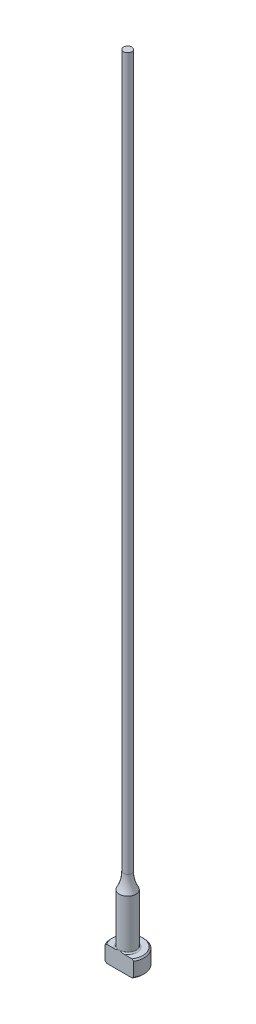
ISO-10303-21;
HEADER;
FILE_DESCRIPTION(('STEP AP214'),'2;1');
FILE_NAME('part.step','',(''),(''),'','','');
FILE_SCHEMA(('AUTOMOTIVE_DESIGN { 1 0 10303 214 1 1 1 1 }'));
ENDSEC;
DATA;
#1=APPLICATION_CONTEXT('core data for automotive mechanical design processes');
#2=APPLICATION_PROTOCOL_DEFINITION('international standard','automotive_design',2000,#1);
#3=PRODUCT_CONTEXT('',#1,'mechanical');
#4=PRODUCT('Part','Part','',(#3));
#5=PRODUCT_RELATED_PRODUCT_CATEGORY('part','',(#4));
#6=PRODUCT_DEFINITION_FORMATION('','',#4);
#7=PRODUCT_DEFINITION_CONTEXT('part definition',#1,'design');
#8=PRODUCT_DEFINITION('design','',#6,#7);
#9=PRODUCT_DEFINITION_SHAPE('','',#8);
#10=(LENGTH_UNIT() NAMED_UNIT(*) SI_UNIT(.MILLI.,.METRE.));
#11=(NAMED_UNIT(*) PLANE_ANGLE_UNIT() SI_UNIT($,.RADIAN.));
#12=(NAMED_UNIT(*) SI_UNIT($,.STERADIAN.) SOLID_ANGLE_UNIT());
#13=UNCERTAINTY_MEASURE_WITH_UNIT(LENGTH_MEASURE(1.E-05),#10,'distance_accuracy_value','');
#14=(GEOMETRIC_REPRESENTATION_CONTEXT(3) GLOBAL_UNCERTAINTY_ASSIGNED_CONTEXT((#13)) GLOBAL_UNIT_ASSIGNED_CONTEXT((#10,
#11,#12)) REPRESENTATION_CONTEXT('',''));
#15=CARTESIAN_POINT('',(0.,0.,0.));
#16=DIRECTION('',(0.,0.,1.));
#17=DIRECTION('',(1.,0.,0.));
#18=AXIS2_PLACEMENT_3D('',#15,#16,#17);
#19=CARTESIAN_POINT('',(-0.793749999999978,152.4,0.));
#20=DIRECTION('',(0.,1.,0.));
#21=DIRECTION('',(0.,0.,1.));
#22=AXIS2_PLACEMENT_3D('',#19,#20,#21);
#23=PLANE('',#22);
#24=CARTESIAN_POINT('',(0.,152.4,0.));
#25=DIRECTION('',(0.,1.,0.));
#26=DIRECTION('',(0.,0.,1.));
#27=AXIS2_PLACEMENT_3D('',#24,#25,#26);
#28=CIRCLE('',#27,0.793749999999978);
#29=CARTESIAN_POINT('',(0.,152.4,0.793749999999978));
#30=VERTEX_POINT('',#29);
#31=EDGE_CURVE('E164',#30,#30,#28,.T.);
#32=ORIENTED_EDGE('',*,*,#31,.T.);
#33=EDGE_LOOP('',(#32));
#34=FACE_BOUND('',#33,.T.);
#35=ADVANCED_FACE('F32',(#34),#23,.T.);
#36=CARTESIAN_POINT('',(0.,259.958771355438,0.));
#37=DIRECTION('',(0.,1.,0.));
#38=DIRECTION('',(0.,0.,1.));
#39=AXIS2_PLACEMENT_3D('',#36,#37,#38);
#40=CYLINDRICAL_SURFACE('',#39,0.793749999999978);
#41=CARTESIAN_POINT('',(0.,15.7741805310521,0.));
#42=DIRECTION('',(0.,1.,0.));
#43=DIRECTION('',(0.,0.,1.));
#44=AXIS2_PLACEMENT_3D('',#41,#42,#43);
#45=CIRCLE('',#44,0.793749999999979);
#46=CARTESIAN_POINT('',(0.,15.7741805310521,0.793749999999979));
#47=VERTEX_POINT('',#46);
#48=EDGE_CURVE('E167',#47,#47,#45,.T.);
#49=ORIENTED_EDGE('',*,*,#48,.T.);
#50=EDGE_LOOP('',(#49));
#51=FACE_BOUND('',#50,.T.);
#52=ORIENTED_EDGE('',*,*,#31,.F.);
#53=EDGE_LOOP('',(#52));
#54=FACE_BOUND('',#53,.T.);
#55=ADVANCED_FACE('F155',(#51,#54),#40,.T.);
#56=CARTESIAN_POINT('',(0.,15.7741805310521,0.));
#57=DIRECTION('',(0.,1.,0.));
#58=DIRECTION('',(0.,0.,1.));
#59=AXIS2_PLACEMENT_3D('',#56,#57,#58);
#60=TOROIDAL_SURFACE('',#59,7.14374999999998,6.35);
#61=CARTESIAN_POINT('',(0.,12.7,0.));
#62=DIRECTION('',(0.,1.,0.));
#63=DIRECTION('',(0.,0.,1.));
#64=AXIS2_PLACEMENT_3D('',#61,#62,#63);
#65=CIRCLE('',#64,1.58749999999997);
#66=CARTESIAN_POINT('',(0.,12.7,1.58749999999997));
#67=VERTEX_POINT('',#66);
#68=EDGE_CURVE('E95',#67,#67,#65,.T.);
#69=ORIENTED_EDGE('',*,*,#68,.T.);
#70=EDGE_LOOP('',(#69));
#71=FACE_BOUND('',#70,.T.);
#72=ORIENTED_EDGE('',*,*,#48,.F.);
#73=EDGE_LOOP('',(#72));
#74=FACE_BOUND('',#73,.T.);
#75=ADVANCED_FACE('F160',(#71,#74),#60,.F.);
#76=CARTESIAN_POINT('',(0.,259.958771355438,0.));
#77=DIRECTION('',(0.,1.,0.));
#78=DIRECTION('',(0.,0.,1.));
#79=AXIS2_PLACEMENT_3D('',#76,#77,#78);
#80=CYLINDRICAL_SURFACE('',#79,1.58749999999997);
#81=CARTESIAN_POINT('',(0.,3.42900000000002,0.));
#82=DIRECTION('',(0.,1.,0.));
#83=DIRECTION('',(0.,0.,1.));
#84=AXIS2_PLACEMENT_3D('',#81,#82,#83);
#85=CIRCLE('',#84,1.58749999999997);
#86=CARTESIAN_POINT('',(0.,3.42900000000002,1.58749999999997));
#87=VERTEX_POINT('',#86);
#88=EDGE_CURVE('E104',#87,#87,#85,.T.);
#89=ORIENTED_EDGE('',*,*,#88,.T.);
#90=EDGE_LOOP('',(#89));
#91=FACE_BOUND('',#90,.T.);
#92=ORIENTED_EDGE('',*,*,#68,.F.);
#93=EDGE_LOOP('',(#92));
#94=FACE_BOUND('',#93,.T.);
#95=ADVANCED_FACE('F187',(#91,#94),#80,.T.);
#96=CARTESIAN_POINT('',(-3.17499999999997,3.175,0.));
#97=DIRECTION('',(0.,1.,0.));
#98=DIRECTION('',(0.,0.,1.));
#99=AXIS2_PLACEMENT_3D('',#96,#97,#98);
#100=PLANE('',#99);
#101=DIRECTION('',(-1.,0.,0.));
#102=VECTOR('',#101,1.);
#103=CARTESIAN_POINT('',(-3.17499999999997,3.175,1.58749999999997));
#104=LINE('',#103,#102);
#105=CARTESIAN_POINT('',(2.45195529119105,3.175,1.58749999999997));
#106=VERTEX_POINT('',#105);
#107=CARTESIAN_POINT('',(0.933255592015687,3.175,1.58749999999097));
#108=VERTEX_POINT('',#107);
#109=EDGE_CURVE('E53',#106,#108,#104,.T.);
#110=ORIENTED_EDGE('',*,*,#109,.F.);
#111=CARTESIAN_POINT('',(0.,3.175,0.));
#112=DIRECTION('',(0.,1.,0.));
#113=DIRECTION('',(0.,0.,1.));
#114=AXIS2_PLACEMENT_3D('',#111,#112,#113);
#115=CIRCLE('',#114,2.92099999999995);
#116=CARTESIAN_POINT('',(-2.45195529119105,3.175,1.58749999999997));
#117=VERTEX_POINT('',#116);
#118=EDGE_CURVE('E166',#106,#117,#115,.T.);
#119=ORIENTED_EDGE('',*,*,#118,.T.);
#120=CARTESIAN_POINT('',(-0.933255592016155,3.17500000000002,1.58749999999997));
#121=VERTEX_POINT('',#120);
#122=EDGE_CURVE('E135',#121,#117,#104,.T.);
#123=ORIENTED_EDGE('',*,*,#122,.F.);
#124=CARTESIAN_POINT('',(0.,3.175,0.));
#125=DIRECTION('',(0.,1.,0.));
#126=DIRECTION('',(0.,0.,1.));
#127=AXIS2_PLACEMENT_3D('',#124,#125,#126);
#128=CIRCLE('',#127,1.84149999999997);
#129=EDGE_CURVE('E108',#121,#108,#128,.F.);
#130=ORIENTED_EDGE('',*,*,#129,.T.);
#131=EDGE_LOOP('',(#110,#119,#123,#130));
#132=FACE_BOUND('',#131,.T.);
#133=ADVANCED_FACE('F184',(#132),#100,.T.);
#134=CARTESIAN_POINT('',(0.,259.958771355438,0.));
#135=DIRECTION('',(0.,1.,0.));
#136=DIRECTION('',(0.,0.,1.));
#137=AXIS2_PLACEMENT_3D('',#134,#135,#136);
#138=CYLINDRICAL_SURFACE('',#137,3.17499999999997);
#139=DIRECTION('',(0.,-1.,0.));
#140=VECTOR('',#139,1.);
#141=CARTESIAN_POINT('',(-2.74963065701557,152.4,1.58749999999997));
#142=LINE('',#141,#140);
#143=CARTESIAN_POINT('',(-2.74963065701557,2.921,1.58749999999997));
#144=VERTEX_POINT('',#143);
#145=CARTESIAN_POINT('',(-2.74963065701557,0.254000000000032,1.58749999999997));
#146=VERTEX_POINT('',#145);
#147=EDGE_CURVE('E90',#144,#146,#142,.T.);
#148=ORIENTED_EDGE('',*,*,#147,.F.);
#149=CARTESIAN_POINT('',(0.,2.92100000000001,0.));
#150=DIRECTION('',(0.,1.,0.));
#151=DIRECTION('',(0.,0.,1.));
#152=AXIS2_PLACEMENT_3D('',#149,#150,#151);
#153=CIRCLE('',#152,3.17499999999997);
#154=CARTESIAN_POINT('',(2.74963065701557,2.921,1.58749999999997));
#155=VERTEX_POINT('',#154);
#156=EDGE_CURVE('E105',#144,#155,#153,.F.);
#157=ORIENTED_EDGE('',*,*,#156,.T.);
#158=DIRECTION('',(0.,-1.,0.));
#159=VECTOR('',#158,1.);
#160=CARTESIAN_POINT('',(2.74963065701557,152.4,1.58749999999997));
#161=LINE('',#160,#159);
#162=CARTESIAN_POINT('',(2.74963065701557,0.254000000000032,1.58749999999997));
#163=VERTEX_POINT('',#162);
#164=EDGE_CURVE('E177',#155,#163,#161,.T.);
#165=ORIENTED_EDGE('',*,*,#164,.T.);
#166=CARTESIAN_POINT('',(0.,0.254000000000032,0.));
#167=DIRECTION('',(0.,-1.,0.));
#168=DIRECTION('',(0.,0.,-1.));
#169=AXIS2_PLACEMENT_3D('',#166,#167,#168);
#170=CIRCLE('',#169,3.17499999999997);
#171=EDGE_CURVE('E111',#163,#146,#170,.F.);
#172=ORIENTED_EDGE('',*,*,#171,.T.);
#173=EDGE_LOOP('',(#148,#157,#165,#172));
#174=FACE_BOUND('',#173,.T.);
#175=ADVANCED_FACE('F175',(#174),#138,.T.);
#176=CARTESIAN_POINT('',(0.,0.,0.));
#177=DIRECTION('',(0.,-1.,0.));
#178=DIRECTION('',(0.,0.,-1.));
#179=AXIS2_PLACEMENT_3D('',#176,#177,#178);
#180=PLANE('',#179);
#181=DIRECTION('',(1.,0.,0.));
#182=VECTOR('',#181,1.);
#183=CARTESIAN_POINT('',(-2.74963065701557,0.,1.58749999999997));
#184=LINE('',#183,#182);
#185=CARTESIAN_POINT('',(-2.45195529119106,0.,1.58749999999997));
#186=VERTEX_POINT('',#185);
#187=CARTESIAN_POINT('',(2.45195529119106,0.,1.58749999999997));
#188=VERTEX_POINT('',#187);
#189=EDGE_CURVE('E87',#186,#188,#184,.T.);
#190=ORIENTED_EDGE('',*,*,#189,.F.);
#191=CARTESIAN_POINT('',(0.,0.,0.));
#192=DIRECTION('',(0.,-1.,0.));
#193=DIRECTION('',(0.,0.,-1.));
#194=AXIS2_PLACEMENT_3D('',#191,#192,#193);
#195=CIRCLE('',#194,2.92099999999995);
#196=EDGE_CURVE('E101',#186,#188,#195,.T.);
#197=ORIENTED_EDGE('',*,*,#196,.T.);
#198=EDGE_LOOP('',(#190,#197));
#199=FACE_BOUND('',#198,.T.);
#200=ADVANCED_FACE('F100',(#199),#180,.T.);
#201=CARTESIAN_POINT('',(0.,3.17499999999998,0.));
#202=DIRECTION('',(0.,-1.,0.));
#203=DIRECTION('',(0.,0.,-1.));
#204=AXIS2_PLACEMENT_3D('',#201,#202,#203);
#205=CONICAL_SURFACE('',#204,2.92099999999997,0.7853981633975);
#206=CARTESIAN_POINT('',(6.0529050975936,-0.161620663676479,1.58749999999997));
#207=CARTESIAN_POINT('',(5.91567682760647,-0.0288893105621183,1.58749999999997));
#208=CARTESIAN_POINT('',(5.77831035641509,0.103699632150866,1.58749999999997));
#209=CARTESIAN_POINT('',(5.5032187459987,0.368508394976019,1.58749999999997));
#210=CARTESIAN_POINT('',(5.36549360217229,0.500728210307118,1.58749999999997));
#211=CARTESIAN_POINT('',(5.08953516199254,0.764778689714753,1.58749999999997));
#212=CARTESIAN_POINT('',(4.95130164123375,0.896609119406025,1.58749999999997));
#213=CARTESIAN_POINT('',(4.67428233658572,1.15968706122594,1.58749999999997));
#214=CARTESIAN_POINT('',(4.53549655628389,1.29093457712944,1.58749999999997));
#215=CARTESIAN_POINT('',(4.2599772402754,1.55007705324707,1.58749999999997));
#216=CARTESIAN_POINT('',(4.12325766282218,1.67798684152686,1.58749999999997));
#217=CARTESIAN_POINT('',(3.84892898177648,1.93284861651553,1.58749999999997));
#218=CARTESIAN_POINT('',(3.71131988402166,2.05980060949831,1.58749999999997));
#219=CARTESIAN_POINT('',(3.43493978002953,2.31237508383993,1.58749999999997));
#220=CARTESIAN_POINT('',(3.29616903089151,2.43799784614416,1.58749999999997));
#221=CARTESIAN_POINT('',(3.01699558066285,2.68741369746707,1.58749999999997));
#222=CARTESIAN_POINT('',(2.87659294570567,2.81120686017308,1.58749999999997));
#223=CARTESIAN_POINT('',(2.6481670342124,3.0087586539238,1.58749999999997));
#224=CARTESIAN_POINT('',(2.56087478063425,3.08336151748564,1.58749999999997));
#225=CARTESIAN_POINT('',(2.38515423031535,3.23123871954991,1.58749999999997));
#226=CARTESIAN_POINT('',(2.29672582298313,3.30451292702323,1.58749999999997));
#227=CARTESIAN_POINT('',(2.1174740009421,3.45004422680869,1.58749999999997));
#228=CARTESIAN_POINT('',(2.02663514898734,3.52228237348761,1.58749999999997));
#229=CARTESIAN_POINT('',(1.8430252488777,3.66423097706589,1.58749999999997));
#230=CARTESIAN_POINT('',(1.75025467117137,3.73394203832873,1.58749999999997));
#231=CARTESIAN_POINT('',(1.56067475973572,3.87080633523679,1.58749999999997));
#232=CARTESIAN_POINT('',(1.4638254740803,3.93790459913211,1.58749999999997));
#233=CARTESIAN_POINT('',(1.266325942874,4.06669147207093,1.58749999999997));
#234=CARTESIAN_POINT('',(1.16567073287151,4.12837264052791,1.58749999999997));
#235=CARTESIAN_POINT('',(1.01165766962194,4.2140225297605,1.58749999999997));
#236=CARTESIAN_POINT('',(0.960142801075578,4.24127929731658,1.58749999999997));
#237=CARTESIAN_POINT('',(0.855780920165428,4.29309798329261,1.58749999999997));
#238=CARTESIAN_POINT('',(0.802933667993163,4.31765941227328,1.58749999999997));
#239=CARTESIAN_POINT('',(0.642461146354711,4.38614656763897,1.58749999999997));
#240=CARTESIAN_POINT('',(0.532518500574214,4.42510149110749,1.58749999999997));
#241=CARTESIAN_POINT('',(0.36768038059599,4.46726244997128,1.58749999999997));
#242=CARTESIAN_POINT('',(0.314802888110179,4.47844427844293,1.58749999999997));
#243=CARTESIAN_POINT('',(0.208209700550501,4.495766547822,1.58749999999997));
#244=CARTESIAN_POINT('',(0.154494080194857,4.50190743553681,1.58749999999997));
#245=CARTESIAN_POINT('',(0.0468792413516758,4.50871296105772,1.58749999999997));
#246=CARTESIAN_POINT('',(-0.00701889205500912,4.50939451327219,1.58749999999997));
#247=CARTESIAN_POINT('',(-0.114606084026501,4.50527679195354,1.58749999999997));
#248=CARTESIAN_POINT('',(-0.16829512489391,4.50047706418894,1.58749999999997));
#249=CARTESIAN_POINT('',(-0.274485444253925,4.48579689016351,1.58749999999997));
#250=CARTESIAN_POINT('',(-0.326992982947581,4.47596081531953,1.58749999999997));
#251=CARTESIAN_POINT('',(-0.430974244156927,4.45181809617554,1.58749999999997));
#252=CARTESIAN_POINT('',(-0.482447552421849,4.43750969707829,1.58749999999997));
#253=CARTESIAN_POINT('',(-0.584460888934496,4.40502489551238,1.58749999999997));
#254=CARTESIAN_POINT('',(-0.63499406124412,4.38682724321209,1.58749999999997));
#255=CARTESIAN_POINT('',(-0.734789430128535,4.34729308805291,1.58749999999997));
#256=CARTESIAN_POINT('',(-0.784051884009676,4.32595722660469,1.58749999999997));
#257=CARTESIAN_POINT('',(-0.930549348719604,4.25791922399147,1.58749999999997));
#258=CARTESIAN_POINT('',(-1.02598802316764,4.20736047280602,1.58749999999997));
#259=CARTESIAN_POINT('',(-1.21304313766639,4.09955451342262,1.58749999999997));
#260=CARTESIAN_POINT('',(-1.30465471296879,4.04229912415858,1.58749999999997));
#261=CARTESIAN_POINT('',(-1.48526211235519,3.9230874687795,1.58749999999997));
#262=CARTESIAN_POINT('',(-1.57424615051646,3.86111349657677,1.58749999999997));
#263=CARTESIAN_POINT('',(-1.74990003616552,3.73408621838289,1.58749999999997));
#264=CARTESIAN_POINT('',(-1.83657099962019,3.66903444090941,1.58749999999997));
#265=CARTESIAN_POINT('',(-2.00931764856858,3.53583371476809,1.58749999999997));
#266=CARTESIAN_POINT('',(-2.09537048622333,3.46765527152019,1.58749999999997));
#267=CARTESIAN_POINT('',(-2.26611736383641,3.32960643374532,1.58749999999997));
#268=CARTESIAN_POINT('',(-2.35081125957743,3.25973586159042,1.58749999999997));
#269=CARTESIAN_POINT('',(-2.60290121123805,3.04858139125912,1.58749999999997));
#270=CARTESIAN_POINT('',(-2.76872537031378,2.9054238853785,1.58749999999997));
#271=CARTESIAN_POINT('',(-3.06970913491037,2.64069522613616,1.58749999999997));
#272=CARTESIAN_POINT('',(-3.20528660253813,2.51959458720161,1.58749999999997));
#273=CARTESIAN_POINT('',(-3.47510321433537,2.275904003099,1.58749999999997));
#274=CARTESIAN_POINT('',(-3.60934232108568,2.15331401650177,1.58749999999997));
#275=CARTESIAN_POINT('',(-3.87695374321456,1.90694239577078,1.58749999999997));
#276=CARTESIAN_POINT('',(-4.01032512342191,1.78315974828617,1.58749999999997));
#277=CARTESIAN_POINT('',(-4.2763088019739,1.53478104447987,1.58749999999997));
#278=CARTESIAN_POINT('',(-4.40892109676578,1.41018498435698,1.58749999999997));
#279=CARTESIAN_POINT('',(-4.79499418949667,1.0457468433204,1.58749999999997));
#280=CARTESIAN_POINT('',(-5.04767313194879,0.805076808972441,1.58749999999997));
#281=CARTESIAN_POINT('',(-5.42550911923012,0.443121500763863,1.58749999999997));
#282=CARTESIAN_POINT('',(-5.55118772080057,0.322378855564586,1.58749999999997));
#283=CARTESIAN_POINT('',(-5.80225207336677,0.0805914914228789,1.58749999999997));
#284=CARTESIAN_POINT('',(-5.92763782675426,-0.0404532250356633,1.58749999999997));
#285=CARTESIAN_POINT('',(-6.0529050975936,-0.161620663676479,1.58749999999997));
#286=B_SPLINE_CURVE_WITH_KNOTS('',3,(#206,#207,#208,#209,#210,#211,#212,#213,#214,#215,#216,
#217,#218,#219,#220,#221,#222,#223,#224,#225,#226,#227,#228,#229,#230,#231,#232,#233,#234,#235,
#236,#237,#238,#239,#240,#241,#242,#243,#244,#245,#246,#247,#248,#249,#250,#251,#252,#253,#254,
#255,#256,#257,#258,#259,#260,#261,#262,#263,#264,#265,#266,#267,#268,#269,#270,#271,#272,#273,
#274,#275,#276,#277,#278,#279,#280,#281,#282,#283,#284,#285),.UNSPECIFIED.,.F.,.F.,(4,2,2,2,2,2,
2,2,2,2,2,2,2,2,2,2,2,2,2,2,2,2,2,2,2,2,2,2,2,2,2,2,2,2,2,2,2,2,2,4),(0.,0.572750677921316,
1.14550874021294,1.71856057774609,2.29160869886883,2.85328006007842,3.41494773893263,
3.97649423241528,4.53801804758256,4.88249307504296,5.22700189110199,5.57515326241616,
5.92322081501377,6.27657800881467,6.63041319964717,6.80518126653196,6.97998101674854,
7.32824262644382,7.49018491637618,7.65211285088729,7.813538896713,7.97497832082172,
8.13501929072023,8.29512313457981,8.4561251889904,8.61709438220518,8.94062993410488,
9.26456495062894,9.58978187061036,9.91483894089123,10.2441741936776,10.5735441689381,
11.2306812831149,11.7760337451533,12.3214014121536,12.8672825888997,13.4131663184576,
14.4600164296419,14.9828595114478,15.505698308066),.UNSPECIFIED.);
#287=EDGE_CURVE('E58',#155,#106,#286,.T.);
#288=ORIENTED_EDGE('',*,*,#287,.F.);
#289=ORIENTED_EDGE('',*,*,#156,.F.);
#290=EDGE_CURVE('E128',#117,#144,#286,.T.);
#291=ORIENTED_EDGE('',*,*,#290,.F.);
#292=ORIENTED_EDGE('',*,*,#118,.F.);
#293=EDGE_LOOP('',(#288,#289,#291,#292));
#294=FACE_BOUND('',#293,.T.);
#295=ADVANCED_FACE('F142',(#294),#205,.T.);
#296=CARTESIAN_POINT('',(0.,0.254000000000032,0.));
#297=DIRECTION('',(0.,1.,0.));
#298=DIRECTION('',(0.,0.,1.));
#299=AXIS2_PLACEMENT_3D('',#296,#297,#298);
#300=CONICAL_SURFACE('',#299,3.17499999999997,0.785398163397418);
#301=CARTESIAN_POINT('',(-6.0529050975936,3.33662066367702,1.58749999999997));
#302=CARTESIAN_POINT('',(-5.91567682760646,3.20388931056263,1.58749999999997));
#303=CARTESIAN_POINT('',(-5.77831035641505,3.0713003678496,1.58749999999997));
#304=CARTESIAN_POINT('',(-5.50321874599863,2.80649160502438,1.58749999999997));
#305=CARTESIAN_POINT('',(-5.36549360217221,2.67427178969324,1.58749999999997));
#306=CARTESIAN_POINT('',(-5.08953516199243,2.41022131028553,1.58749999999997));
#307=CARTESIAN_POINT('',(-4.95130164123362,2.27839088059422,1.58749999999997));
#308=CARTESIAN_POINT('',(-4.67428233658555,2.01531293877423,1.58749999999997));
#309=CARTESIAN_POINT('',(-4.5354965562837,1.8840654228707,1.58749999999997));
#310=CARTESIAN_POINT('',(-4.25997724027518,1.62492294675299,1.58749999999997));
#311=CARTESIAN_POINT('',(-4.12325766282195,1.49701315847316,1.58749999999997));
#312=CARTESIAN_POINT('',(-3.84892898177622,1.24215138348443,1.58749999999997));
#313=CARTESIAN_POINT('',(-3.71131988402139,1.11519939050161,1.58749999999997));
#314=CARTESIAN_POINT('',(-3.43493978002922,0.862624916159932,1.58749999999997));
#315=CARTESIAN_POINT('',(-3.29616903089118,0.737002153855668,1.58749999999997));
#316=CARTESIAN_POINT('',(-3.01699558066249,0.487586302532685,1.58749999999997));
#317=CARTESIAN_POINT('',(-2.8765929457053,0.363793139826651,1.58749999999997));
#318=CARTESIAN_POINT('',(-2.64816703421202,0.1662413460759,1.58749999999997));
#319=CARTESIAN_POINT('',(-2.56087478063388,0.0916384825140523,1.58749999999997));
#320=CARTESIAN_POINT('',(-2.385154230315,-0.0562387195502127,1.58749999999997));
#321=CARTESIAN_POINT('',(-2.29672582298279,-0.129512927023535,1.58749999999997));
#322=CARTESIAN_POINT('',(-2.11747400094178,-0.275044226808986,1.58749999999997));
#323=CARTESIAN_POINT('',(-2.02663514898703,-0.34728237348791,1.58749999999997));
#324=CARTESIAN_POINT('',(-1.84302524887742,-0.489230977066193,1.58749999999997));
#325=CARTESIAN_POINT('',(-1.75025467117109,-0.558942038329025,1.58749999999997));
#326=CARTESIAN_POINT('',(-1.56067475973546,-0.695806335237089,1.58749999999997));
#327=CARTESIAN_POINT('',(-1.46382547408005,-0.762904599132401,1.58749999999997));
#328=CARTESIAN_POINT('',(-1.26632594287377,-0.89169147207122,1.58749999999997));
#329=CARTESIAN_POINT('',(-1.16567073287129,-0.953372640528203,1.58749999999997));
#330=CARTESIAN_POINT('',(-1.01165766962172,-1.03902252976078,1.58749999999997));
#331=CARTESIAN_POINT('',(-0.960142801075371,-1.06627929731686,1.58749999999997));
#332=CARTESIAN_POINT('',(-0.855780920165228,-1.11809798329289,1.58749999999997));
#333=CARTESIAN_POINT('',(-0.802933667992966,-1.14265941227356,1.58749999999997));
#334=CARTESIAN_POINT('',(-0.642461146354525,-1.21114656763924,1.58749999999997));
#335=CARTESIAN_POINT('',(-0.532518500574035,-1.25010149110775,1.58749999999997));
#336=CARTESIAN_POINT('',(-0.367680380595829,-1.29226244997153,1.58749999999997));
#337=CARTESIAN_POINT('',(-0.314802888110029,-1.30344427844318,1.58749999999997));
#338=CARTESIAN_POINT('',(-0.208209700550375,-1.32076654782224,1.58749999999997));
#339=CARTESIAN_POINT('',(-0.154494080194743,-1.32690743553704,1.58749999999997));
#340=CARTESIAN_POINT('',(-0.0468792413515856,-1.33371296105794,1.58749999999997));
#341=CARTESIAN_POINT('',(0.00701889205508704,-1.33439451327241,1.58749999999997));
#342=CARTESIAN_POINT('',(0.114606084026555,-1.33027679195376,1.58749999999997));
#343=CARTESIAN_POINT('',(0.168295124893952,-1.32547706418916,1.58749999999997));
#344=CARTESIAN_POINT('',(0.274485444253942,-1.31079689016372,1.58749999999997));
#345=CARTESIAN_POINT('',(0.326992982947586,-1.30096081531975,1.58749999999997));
#346=CARTESIAN_POINT('',(0.430974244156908,-1.27681809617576,1.58749999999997));
#347=CARTESIAN_POINT('',(0.482447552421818,-1.26250969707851,1.58749999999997));
#348=CARTESIAN_POINT('',(0.58446088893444,-1.2300248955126,1.58749999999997));
#349=CARTESIAN_POINT('',(0.634994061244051,-1.21182724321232,1.58749999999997));
#350=CARTESIAN_POINT('',(0.734789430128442,-1.17229308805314,1.58749999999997));
#351=CARTESIAN_POINT('',(0.784051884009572,-1.15095722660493,1.58749999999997));
#352=CARTESIAN_POINT('',(0.930549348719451,-1.08291922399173,1.58749999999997));
#353=CARTESIAN_POINT('',(1.02598802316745,-1.0323604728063,1.58749999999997));
#354=CARTESIAN_POINT('',(1.21304313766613,-0.924554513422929,1.58749999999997));
#355=CARTESIAN_POINT('',(1.30465471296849,-0.867299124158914,1.58749999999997));
#356=CARTESIAN_POINT('',(1.48526211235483,-0.748087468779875,1.58749999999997));
#357=CARTESIAN_POINT('',(1.57424615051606,-0.686113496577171,1.58749999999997));
#358=CARTESIAN_POINT('',(1.74990003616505,-0.559086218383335,1.58749999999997));
#359=CARTESIAN_POINT('',(1.83657099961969,-0.494034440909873,1.58749999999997));
#360=CARTESIAN_POINT('',(2.00931764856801,-0.360833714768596,1.58749999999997));
#361=CARTESIAN_POINT('',(2.09537048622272,-0.292655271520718,1.58749999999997));
#362=CARTESIAN_POINT('',(2.26611736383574,-0.1546064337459,1.58749999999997));
#363=CARTESIAN_POINT('',(2.35081125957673,-0.0847358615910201,1.58749999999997));
#364=CARTESIAN_POINT('',(2.60290121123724,0.126418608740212,1.58749999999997));
#365=CARTESIAN_POINT('',(2.76872537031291,0.269576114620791,1.58749999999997));
#366=CARTESIAN_POINT('',(3.06970913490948,0.534304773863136,1.58749999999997));
#367=CARTESIAN_POINT('',(3.20528660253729,0.65540541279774,1.58749999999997));
#368=CARTESIAN_POINT('',(3.47510321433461,0.899095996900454,1.58749999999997));
#369=CARTESIAN_POINT('',(3.60934232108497,1.02168598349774,1.58749999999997));
#370=CARTESIAN_POINT('',(3.87695374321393,1.26805760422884,1.58749999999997));
#371=CARTESIAN_POINT('',(4.01032512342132,1.39184025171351,1.58749999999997));
#372=CARTESIAN_POINT('',(4.2763088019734,1.64021895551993,1.58749999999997));
#373=CARTESIAN_POINT('',(4.40892109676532,1.76481501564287,1.58749999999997));
#374=CARTESIAN_POINT('',(4.79499418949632,2.12925315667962,1.58749999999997));
#375=CARTESIAN_POINT('',(5.04767313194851,2.36992319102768,1.58749999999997));
#376=CARTESIAN_POINT('',(5.42550911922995,2.73187849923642,1.58749999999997));
#377=CARTESIAN_POINT('',(5.55118772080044,2.85262114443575,1.58749999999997));
#378=CARTESIAN_POINT('',(5.8022520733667,3.09440850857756,1.58749999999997));
#379=CARTESIAN_POINT('',(5.92763782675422,3.21545322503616,1.58749999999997));
#380=CARTESIAN_POINT('',(6.0529050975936,3.33662066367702,1.58749999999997));
#381=B_SPLINE_CURVE_WITH_KNOTS('',3,(#301,#302,#303,#304,#305,#306,#307,#308,#309,#310,#311,
#312,#313,#314,#315,#316,#317,#318,#319,#320,#321,#322,#323,#324,#325,#326,#327,#328,#329,#330,
#331,#332,#333,#334,#335,#336,#337,#338,#339,#340,#341,#342,#343,#344,#345,#346,#347,#348,#349,
#350,#351,#352,#353,#354,#355,#356,#357,#358,#359,#360,#361,#362,#363,#364,#365,#366,#367,#368,
#369,#370,#371,#372,#373,#374,#375,#376,#377,#378,#379,#380),.UNSPECIFIED.,.F.,.F.,(4,2,2,2,2,2,
2,2,2,2,2,2,2,2,2,2,2,2,2,2,2,2,2,2,2,2,2,2,2,2,2,2,2,2,2,2,2,2,2,4),(0.,0.57275067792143,
1.14550874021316,1.71856057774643,2.29160869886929,2.85328006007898,3.41494773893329,
3.97649423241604,4.53801804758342,4.8824930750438,5.22700189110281,5.57515326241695,
5.92322081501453,6.27657800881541,6.63041319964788,6.80518126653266,6.97998101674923,
7.32824262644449,7.49018491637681,7.65211285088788,7.81353889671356,7.97497832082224,
8.13501929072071,8.29512313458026,8.45612518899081,8.61709438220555,8.94062993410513,
9.26456495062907,9.58978187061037,9.91483894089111,10.2441741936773,10.5735441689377,
11.2306812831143,11.776033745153,12.3214014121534,12.8672825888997,13.4131663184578,
14.4600164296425,14.9828595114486,15.505698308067),.UNSPECIFIED.);
#382=EDGE_CURVE('E84',#146,#186,#381,.T.);
#383=ORIENTED_EDGE('',*,*,#382,.F.);
#384=ORIENTED_EDGE('',*,*,#171,.F.);
#385=EDGE_CURVE('E96',#188,#163,#381,.T.);
#386=ORIENTED_EDGE('',*,*,#385,.F.);
#387=ORIENTED_EDGE('',*,*,#196,.F.);
#388=EDGE_LOOP('',(#383,#384,#386,#387));
#389=FACE_BOUND('',#388,.T.);
#390=ADVANCED_FACE('F103',(#389),#300,.T.);
#391=CARTESIAN_POINT('',(0.,3.42900000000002,0.));
#392=DIRECTION('',(0.,1.,0.));
#393=DIRECTION('',(0.,0.,1.));
#394=AXIS2_PLACEMENT_3D('',#391,#392,#393);
#395=TOROIDAL_SURFACE('',#394,1.84149999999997,0.254);
#396=ORIENTED_EDGE('',*,*,#129,.F.);
#397=CARTESIAN_POINT('',(0.,3.42900000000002,1.58749999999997));
#398=CARTESIAN_POINT('',(-1.92205022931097E-10,3.42900057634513,1.58749999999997));
#399=CARTESIAN_POINT('',(-1.22611612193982E-07,3.42900115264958,1.58749999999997));
#400=CARTESIAN_POINT('',(-5.09676358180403E-07,3.42900226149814,1.58749999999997));
#401=CARTESIAN_POINT('',(-7.78176318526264E-07,3.42900279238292,1.58749999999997));
#402=CARTESIAN_POINT('',(-1.42307271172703E-06,3.42900385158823,1.58749999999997));
#403=CARTESIAN_POINT('',(-1.80713865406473E-06,3.4290043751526,1.58749999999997));
#404=CARTESIAN_POINT('',(-2.63494844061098E-06,3.42900536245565,1.58749999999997));
#405=CARTESIAN_POINT('',(-3.07814754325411E-06,3.42900582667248,1.58749999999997));
#406=CARTESIAN_POINT('',(-4.6689735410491E-06,3.4290073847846,1.58749999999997));
#407=CARTESIAN_POINT('',(-5.89404904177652E-06,3.42900840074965,1.58749999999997));
#408=CARTESIAN_POINT('',(-8.42427506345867E-06,3.42901020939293,1.58749999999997));
#409=CARTESIAN_POINT('',(-9.72480569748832E-06,3.42901100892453,1.58749999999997));
#410=CARTESIAN_POINT('',(-1.48060601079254E-05,3.42901401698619,1.58749999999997));
#411=CARTESIAN_POINT('',(-1.86838280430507E-05,3.42901606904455,1.58749999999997));
#412=CARTESIAN_POINT('',(-2.6326111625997E-05,3.42901942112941,1.58749999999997));
#413=CARTESIAN_POINT('',(-3.00687416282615E-05,3.42902077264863,1.58749999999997));
#414=CARTESIAN_POINT('',(-4.6027629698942E-05,3.4290265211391,1.58749999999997));
#415=CARTESIAN_POINT('',(-5.82470196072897E-05,3.42903088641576,1.58749999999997));
#416=CARTESIAN_POINT('',(-8.11070094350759E-05,3.42903788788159,1.58749999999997));
#417=CARTESIAN_POINT('',(-9.16953111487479E-05,3.42904068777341,1.58749999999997));
#418=CARTESIAN_POINT('',(-0.000168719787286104,3.42906287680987,1.58749999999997));
#419=CARTESIAN_POINT('',(-0.000232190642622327,3.42909118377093,1.58749999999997));
#420=CARTESIAN_POINT('',(-0.000479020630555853,3.42919723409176,1.58749999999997));
#421=CARTESIAN_POINT('',(-0.000664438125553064,3.42926834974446,1.58749999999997));
#422=CARTESIAN_POINT('',(-0.00138448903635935,3.4295486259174,1.58749999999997));
#423=CARTESIAN_POINT('',(-0.00191701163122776,3.42976473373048,1.58749999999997));
#424=CARTESIAN_POINT('',(-0.00409774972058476,3.43064550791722,1.58749999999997));
#425=CARTESIAN_POINT('',(-0.00574830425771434,3.43130231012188,1.58749999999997));
#426=CARTESIAN_POINT('',(-0.0289985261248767,3.44055947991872,1.58749999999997));
#427=CARTESIAN_POINT('',(-0.0505816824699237,3.44921674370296,1.58749999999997));
#428=CARTESIAN_POINT('',(-0.0929947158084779,3.46610702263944,1.58749999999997));
#429=CARTESIAN_POINT('',(-0.113823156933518,3.47434394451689,1.58749999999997));
#430=CARTESIAN_POINT('',(-0.157956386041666,3.49164606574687,1.58749999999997));
#431=CARTESIAN_POINT('',(-0.181267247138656,3.50069608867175,1.58749999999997));
#432=CARTESIAN_POINT('',(-0.228222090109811,3.51863224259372,1.58749999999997));
#433=CARTESIAN_POINT('',(-0.251867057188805,3.52751579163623,1.58749999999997));
#434=CARTESIAN_POINT('',(-0.310512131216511,3.54905503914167,1.58749999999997));
#435=CARTESIAN_POINT('',(-0.345588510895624,3.56150550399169,1.58749999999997));
#436=CARTESIAN_POINT('',(-0.415278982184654,3.58503024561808,1.58749999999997));
#437=CARTESIAN_POINT('',(-0.449884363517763,3.59613012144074,1.58749999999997));
#438=CARTESIAN_POINT('',(-0.52447121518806,3.61841679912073,1.58749999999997));
#439=CARTESIAN_POINT('',(-0.56451722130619,3.62939137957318,1.58749999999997));
#440=CARTESIAN_POINT('',(-0.645529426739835,3.6489746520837,1.58749999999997));
#441=CARTESIAN_POINT('',(-0.686500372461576,3.65756417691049,1.58749999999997));
#442=CARTESIAN_POINT('',(-0.771546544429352,3.67188287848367,1.58749999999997));
#443=CARTESIAN_POINT('',(-0.815658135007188,3.67740449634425,1.58749999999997));
#444=CARTESIAN_POINT('',(-0.904117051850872,3.68344603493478,1.58749999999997));
#445=CARTESIAN_POINT('',(-0.948462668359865,3.68398638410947,1.58749999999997));
#446=CARTESIAN_POINT('',(-1.02531896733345,3.67901051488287,1.58749999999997));
#447=CARTESIAN_POINT('',(-1.05792141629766,3.67502604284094,1.58749999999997));
#448=CARTESIAN_POINT('',(-1.12184393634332,3.6623083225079,1.58749999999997));
#449=CARTESIAN_POINT('',(-1.15317534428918,3.65363950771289,1.58749999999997));
#450=CARTESIAN_POINT('',(-1.19946468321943,3.63563847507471,1.58749999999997));
#451=CARTESIAN_POINT('',(-1.2152678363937,3.62848492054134,1.58749999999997));
#452=CARTESIAN_POINT('',(-1.24583726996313,3.61212937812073,1.58749999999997));
#453=CARTESIAN_POINT('',(-1.26060215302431,3.60292469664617,1.58749999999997));
#454=CARTESIAN_POINT('',(-1.28575815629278,3.58421518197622,1.58749999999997));
#455=CARTESIAN_POINT('',(-1.29644383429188,3.57510998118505,1.58749999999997));
#456=CARTESIAN_POINT('',(-1.31623154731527,3.55531539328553,1.58749999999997));
#457=CARTESIAN_POINT('',(-1.32533681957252,3.54462932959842,1.58749999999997));
#458=CARTESIAN_POINT('',(-1.33941140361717,3.52450022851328,1.58749999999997));
#459=CARTESIAN_POINT('',(-1.34484814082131,3.51538553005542,1.58749999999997));
#460=CARTESIAN_POINT('',(-1.35416329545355,3.49638544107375,1.58749999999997));
#461=CARTESIAN_POINT('',(-1.35804267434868,3.48650053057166,1.58749999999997));
#462=CARTESIAN_POINT('',(-1.36398436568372,3.46611321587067,1.58749999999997));
#463=CARTESIAN_POINT('',(-1.36603350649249,3.45560690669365,1.58749999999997));
#464=CARTESIAN_POINT('',(-1.3680840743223,3.43439627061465,1.58749999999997));
#465=CARTESIAN_POINT('',(-1.36808648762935,3.42369204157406,1.58749999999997));
#466=CARTESIAN_POINT('',(-1.36616208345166,3.40366716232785,1.58749999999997));
#467=CARTESIAN_POINT('',(-1.36444960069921,3.39432493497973,1.58749999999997));
#468=CARTESIAN_POINT('',(-1.35953338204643,3.37604480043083,1.58749999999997));
#469=CARTESIAN_POINT('',(-1.3563294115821,3.36710695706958,1.58749999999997));
#470=CARTESIAN_POINT('',(-1.34848006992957,3.34949697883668,1.58749999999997));
#471=CARTESIAN_POINT('',(-1.34378578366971,3.34084688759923,1.58749999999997));
#472=CARTESIAN_POINT('',(-1.33324445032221,3.32428742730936,1.58749999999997));
#473=CARTESIAN_POINT('',(-1.32739692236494,3.3163783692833,1.58749999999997));
#474=CARTESIAN_POINT('',(-1.3110730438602,3.29692878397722,1.58749999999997));
#475=CARTESIAN_POINT('',(-1.29989286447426,3.28597778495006,1.58749999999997));
#476=CARTESIAN_POINT('',(-1.27593566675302,3.26597490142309,1.58749999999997));
#477=CARTESIAN_POINT('',(-1.26315370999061,3.25692913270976,1.58749999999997));
#478=CARTESIAN_POINT('',(-1.2293073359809,3.23613976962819,1.58749999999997));
#479=CARTESIAN_POINT('',(-1.20751096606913,3.225594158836,1.58749999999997));
#480=CARTESIAN_POINT('',(-1.16266144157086,3.20795356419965,1.58749999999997));
#481=CARTESIAN_POINT('',(-1.13960937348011,3.20085564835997,1.58749999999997));
#482=CARTESIAN_POINT('',(-1.07603916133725,3.18534571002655,1.58749999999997));
#483=CARTESIAN_POINT('',(-1.03486686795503,3.17965078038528,1.58749999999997));
#484=CARTESIAN_POINT('',(-0.951558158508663,3.1741711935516,1.58749999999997));
#485=CARTESIAN_POINT('',(-0.909417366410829,3.17449023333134,1.58749999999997));
#486=CARTESIAN_POINT('',(-0.811383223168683,3.18054602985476,1.58749999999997));
#487=CARTESIAN_POINT('',(-0.755610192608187,3.18806126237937,1.58749999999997));
#488=CARTESIAN_POINT('',(-0.64493786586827,3.20866626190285,1.58749999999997));
#489=CARTESIAN_POINT('',(-0.59004364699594,3.22178102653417,1.58749999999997));
#490=CARTESIAN_POINT('',(-0.485757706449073,3.25059077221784,1.58749999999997));
#491=CARTESIAN_POINT('',(-0.436281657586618,3.26598903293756,1.58749999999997));
#492=CARTESIAN_POINT('',(-0.338551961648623,3.29877502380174,1.58749999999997));
#493=CARTESIAN_POINT('',(-0.290291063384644,3.31614156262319,1.58749999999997));
#494=CARTESIAN_POINT('',(-0.22555793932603,3.34039762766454,1.58749999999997));
#495=CARTESIAN_POINT('',(-0.208874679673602,3.34673586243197,1.58749999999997));
#496=CARTESIAN_POINT('',(-0.175123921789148,3.35969957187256,1.58749999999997));
#497=CARTESIAN_POINT('',(-0.158057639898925,3.36632823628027,1.58749999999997));
#498=CARTESIAN_POINT('',(-0.117638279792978,3.38214476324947,1.58749999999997));
#499=CARTESIAN_POINT('',(-0.0943002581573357,3.39137029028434,1.58749999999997));
#500=CARTESIAN_POINT('',(-0.0497824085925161,3.40910304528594,1.58749999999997));
#501=CARTESIAN_POINT('',(-0.0285986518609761,3.41759960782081,1.58749999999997));
#502=CARTESIAN_POINT('',(-0.00575168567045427,3.42669635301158,1.58749999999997));
#503=CARTESIAN_POINT('',(-0.00410451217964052,3.42735181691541,1.58749999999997));
#504=CARTESIAN_POINT('',(-0.00192459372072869,3.42823223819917,1.58749999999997));
#505=CARTESIAN_POINT('',(-0.00138952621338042,3.42844937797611,1.58749999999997));
#506=CARTESIAN_POINT('',(-0.000666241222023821,3.42873091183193,1.58749999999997));
#507=CARTESIAN_POINT('',(-0.000480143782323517,3.42880228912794,1.58749999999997));
#508=CARTESIAN_POINT('',(-0.000232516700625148,3.42890868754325,1.58749999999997));
#509=CARTESIAN_POINT('',(-0.00016892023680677,3.42893705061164,1.58749999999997));
#510=CARTESIAN_POINT('',(-9.17527158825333E-05,3.42895927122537,1.58749999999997));
#511=CARTESIAN_POINT('',(-8.11550290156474E-05,3.42896207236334,1.58749999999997));
#512=CARTESIAN_POINT('',(-5.82743946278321E-05,3.42896908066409,1.58749999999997));
#513=CARTESIAN_POINT('',(-4.60439999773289E-05,3.42897345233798,1.58749999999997));
#514=CARTESIAN_POINT('',(-3.00727680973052E-05,3.42897920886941,1.58749999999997));
#515=CARTESIAN_POINT('',(-2.63286806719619E-05,3.42898056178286,1.58749999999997));
#516=CARTESIAN_POINT('',(-1.86836528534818E-05,3.42898391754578,1.58749999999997));
#517=CARTESIAN_POINT('',(-1.48046516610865E-05,3.42898597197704,1.58749999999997));
#518=CARTESIAN_POINT('',(-9.72223938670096E-06,3.42898898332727,1.58749999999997));
#519=CARTESIAN_POINT('',(-8.4215964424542E-06,3.42898978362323,1.58749999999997));
#520=CARTESIAN_POINT('',(-5.89129725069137E-06,3.42899159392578,1.58749999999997));
#521=CARTESIAN_POINT('',(-4.66626863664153E-06,3.42899261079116,1.58749999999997));
#522=CARTESIAN_POINT('',(-3.07568801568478E-06,3.42899417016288,1.58749999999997));
#523=CARTESIAN_POINT('',(-2.63259563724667E-06,3.4289946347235,1.58749999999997));
#524=CARTESIAN_POINT('',(-1.80506083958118E-06,3.42899562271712,1.58749999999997));
#525=CARTESIAN_POINT('',(-1.42116386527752E-06,3.4289961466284,1.58749999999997));
#526=CARTESIAN_POINT('',(-7.76675633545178E-07,3.42899720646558,1.58749999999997));
#527=CARTESIAN_POINT('',(-5.0840648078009E-07,3.42899773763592,1.58749999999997));
#528=CARTESIAN_POINT('',(-1.21901884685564E-07,3.42899884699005,1.58749999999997));
#529=CARTESIAN_POINT('',(1.92251552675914E-10,3.42899942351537,1.58749999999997));
#530=CARTESIAN_POINT('',(0.,3.42900000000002,1.58749999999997));
#531=B_SPLINE_CURVE_WITH_KNOTS('',3,(#397,#398,#399,#400,#401,#402,#403,#404,#405,#406,#407,
#408,#409,#410,#411,#412,#413,#414,#415,#416,#417,#418,#419,#420,#421,#422,#423,#424,#425,#426,
#427,#428,#429,#430,#431,#432,#433,#434,#435,#436,#437,#438,#439,#440,#441,#442,#443,#444,#445,
#446,#447,#448,#449,#450,#451,#452,#453,#454,#455,#456,#457,#458,#459,#460,#461,#462,#463,#464,
#465,#466,#467,#468,#469,#470,#471,#472,#473,#474,#475,#476,#477,#478,#479,#480,#481,#482,#483,
#484,#485,#486,#487,#488,#489,#490,#491,#492,#493,#494,#495,#496,#497,#498,#499,#500,#501,#502,
#503,#504,#505,#506,#507,#508,#509,#510,#511,#512,#513,#514,#515,#516,#517,#518,#519,#520,#521,
#522,#523,#524,#525,#526,#527,#528,#529,#530),.UNSPECIFIED.,.T.,.F.,(4,2,2,2,2,2,2,2,2,2,2,2,2,
2,2,2,2,2,2,2,2,2,2,2,2,2,2,2,2,2,2,2,2,2,2,2,2,2,2,2,2,2,2,2,2,2,2,2,2,2,2,2,2,2,2,2,2,2,2,2,2,
2,2,2,2,2,4),(0.,1.72815463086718E-06,3.50429263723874E-06,5.44431015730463E-06,
7.36755264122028E-06,1.2119089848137E-05,1.66953777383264E-05,2.98160402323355E-05,
4.17409566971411E-05,8.06604755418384E-05,0.000113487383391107,0.000321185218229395,
0.000917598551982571,0.00264089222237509,0.00797105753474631,0.0777276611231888,
0.144923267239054,0.21993959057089,0.295714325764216,0.407362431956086,0.51636778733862,
0.640878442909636,0.766362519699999,0.899536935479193,1.03216495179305,1.13045740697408,
1.22743103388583,1.27935899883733,1.33135556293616,1.37333248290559,1.41522237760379,
1.44693946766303,1.47863694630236,1.51056074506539,1.54246916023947,1.57083210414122,
1.59919951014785,1.62861579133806,1.65804436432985,1.70472658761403,1.75155645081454,
1.82378709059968,1.89595619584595,2.01995471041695,2.14609321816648,2.31447224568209,
2.4836109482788,2.63898919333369,2.79283011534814,2.84637031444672,2.90129461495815,
2.97658236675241,3.04504771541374,3.05036697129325,3.052098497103,3.05269709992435,
3.05290520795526,3.05293806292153,3.05297701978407,3.05298895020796,3.05300207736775,
3.05300665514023,3.05301140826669,3.05301333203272,3.05301527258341,3.05301704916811,
3.0530187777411),.UNSPECIFIED.);
#532=EDGE_CURVE('E11',#121,#87,#531,.T.);
#533=ORIENTED_EDGE('',*,*,#532,.T.);
#534=ORIENTED_EDGE('',*,*,#88,.F.);
#535=CARTESIAN_POINT('',(0.,3.42900000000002,1.58749999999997));
#536=CARTESIAN_POINT('',(1.92205049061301E-10,3.4289994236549,1.58749999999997));
#537=CARTESIAN_POINT('',(1.22611612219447E-07,3.42899884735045,1.58749999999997));
#538=CARTESIAN_POINT('',(5.09676358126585E-07,3.42899773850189,1.58749999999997));
#539=CARTESIAN_POINT('',(7.78176318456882E-07,3.42899720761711,1.58749999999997));
#540=CARTESIAN_POINT('',(1.42307271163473E-06,3.4289961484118,1.58749999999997));
#541=CARTESIAN_POINT('',(1.80713865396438E-06,3.42899562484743,1.58749999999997));
#542=CARTESIAN_POINT('',(2.63494844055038E-06,3.42899463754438,1.58749999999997));
#543=CARTESIAN_POINT('',(3.07814754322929E-06,3.42899417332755,1.58749999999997));
#544=CARTESIAN_POINT('',(4.66897354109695E-06,3.42899261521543,1.58749999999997));
#545=CARTESIAN_POINT('',(5.89404904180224E-06,3.42899159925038,1.58749999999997));
#546=CARTESIAN_POINT('',(8.42427506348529E-06,3.4289897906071,1.58749999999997));
#547=CARTESIAN_POINT('',(9.72480569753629E-06,3.4289889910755,1.58749999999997));
#548=CARTESIAN_POINT('',(1.48060601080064E-05,3.42898598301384,1.58749999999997));
#549=CARTESIAN_POINT('',(1.86838280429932E-05,3.42898393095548,1.58749999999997));
#550=CARTESIAN_POINT('',(2.63261116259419E-05,3.42898057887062,1.58749999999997));
#551=CARTESIAN_POINT('',(3.00687416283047E-05,3.4289792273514,1.58749999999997));
#552=CARTESIAN_POINT('',(4.60276296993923E-05,3.42897347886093,1.58749999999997));
#553=CARTESIAN_POINT('',(5.8247019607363E-05,3.42896911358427,1.58749999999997));
#554=CARTESIAN_POINT('',(8.11070094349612E-05,3.42896211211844,1.58749999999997));
#555=CARTESIAN_POINT('',(9.1695311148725E-05,3.42895931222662,1.58749999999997));
#556=CARTESIAN_POINT('',(0.000168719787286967,3.42893712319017,1.58749999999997));
#557=CARTESIAN_POINT('',(0.000232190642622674,3.4289088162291,1.58749999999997));
#558=CARTESIAN_POINT('',(0.000479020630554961,3.42880276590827,1.58749999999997));
#559=CARTESIAN_POINT('',(0.000664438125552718,3.42873165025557,1.58749999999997));
#560=CARTESIAN_POINT('',(0.00138448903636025,3.42845137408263,1.58749999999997));
#561=CARTESIAN_POINT('',(0.00191701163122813,3.42823526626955,1.58749999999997));
#562=CARTESIAN_POINT('',(0.00409774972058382,3.42735449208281,1.58749999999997));
#563=CARTESIAN_POINT('',(0.0057483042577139,3.42669768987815,1.58749999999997));
#564=CARTESIAN_POINT('',(0.0289985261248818,3.41744052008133,1.58749999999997));
#565=CARTESIAN_POINT('',(0.0505816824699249,3.40878325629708,1.58749999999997));
#566=CARTESIAN_POINT('',(0.0929947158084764,3.39189297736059,1.58749999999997));
#567=CARTESIAN_POINT('',(0.113823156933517,3.38365605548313,1.58749999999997));
#568=CARTESIAN_POINT('',(0.157956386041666,3.36635393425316,1.58749999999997));
#569=CARTESIAN_POINT('',(0.181267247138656,3.35730391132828,1.58749999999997));
#570=CARTESIAN_POINT('',(0.228222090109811,3.33936775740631,1.58749999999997));
#571=CARTESIAN_POINT('',(0.251867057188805,3.3304842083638,1.58749999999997));
#572=CARTESIAN_POINT('',(0.310512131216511,3.30894496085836,1.58749999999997));
#573=CARTESIAN_POINT('',(0.345588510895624,3.29649449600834,1.58749999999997));
#574=CARTESIAN_POINT('',(0.415278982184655,3.27296975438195,1.58749999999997));
#575=CARTESIAN_POINT('',(0.449884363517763,3.26186987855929,1.58749999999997));
#576=CARTESIAN_POINT('',(0.52447121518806,3.23958320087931,1.58749999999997));
#577=CARTESIAN_POINT('',(0.564517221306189,3.22860862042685,1.58749999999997));
#578=CARTESIAN_POINT('',(0.645529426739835,3.20902534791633,1.58749999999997));
#579=CARTESIAN_POINT('',(0.686500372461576,3.20043582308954,1.58749999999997));
#580=CARTESIAN_POINT('',(0.771546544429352,3.18611712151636,1.58749999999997));
#581=CARTESIAN_POINT('',(0.815658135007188,3.18059550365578,1.58749999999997));
#582=CARTESIAN_POINT('',(0.904117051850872,3.17455396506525,1.58749999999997));
#583=CARTESIAN_POINT('',(0.948462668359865,3.17401361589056,1.58749999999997));
#584=CARTESIAN_POINT('',(1.02531896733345,3.17898948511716,1.58749999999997));
#585=CARTESIAN_POINT('',(1.05792141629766,3.1829739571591,1.58749999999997));
#586=CARTESIAN_POINT('',(1.12184393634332,3.19569167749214,1.58749999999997));
#587=CARTESIAN_POINT('',(1.15317534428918,3.20436049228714,1.58749999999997));
#588=CARTESIAN_POINT('',(1.19946468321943,3.22236152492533,1.58749999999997));
#589=CARTESIAN_POINT('',(1.2152678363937,3.22951507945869,1.58749999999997));
#590=CARTESIAN_POINT('',(1.24583726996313,3.2458706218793,1.58749999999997));
#591=CARTESIAN_POINT('',(1.26060215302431,3.25507530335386,1.58749999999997));
#592=CARTESIAN_POINT('',(1.28575815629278,3.27378481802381,1.58749999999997));
#593=CARTESIAN_POINT('',(1.29644383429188,3.28289001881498,1.58749999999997));
#594=CARTESIAN_POINT('',(1.31623154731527,3.3026846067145,1.58749999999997));
#595=CARTESIAN_POINT('',(1.32533681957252,3.31337067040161,1.58749999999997));
#596=CARTESIAN_POINT('',(1.33941140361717,3.33349977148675,1.58749999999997));
#597=CARTESIAN_POINT('',(1.34484814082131,3.34261446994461,1.58749999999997));
#598=CARTESIAN_POINT('',(1.35416329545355,3.36161455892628,1.58749999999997));
#599=CARTESIAN_POINT('',(1.35804267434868,3.37149946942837,1.58749999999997));
#600=CARTESIAN_POINT('',(1.36398436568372,3.39188678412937,1.58749999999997));
#601=CARTESIAN_POINT('',(1.36603350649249,3.40239309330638,1.58749999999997));
#602=CARTESIAN_POINT('',(1.3680840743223,3.42360372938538,1.58749999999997));
#603=CARTESIAN_POINT('',(1.36808648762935,3.43430795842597,1.58749999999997));
#604=CARTESIAN_POINT('',(1.36616208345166,3.45433283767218,1.58749999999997));
#605=CARTESIAN_POINT('',(1.36444960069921,3.4636750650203,1.58749999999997));
#606=CARTESIAN_POINT('',(1.35953338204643,3.4819551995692,1.58749999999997));
#607=CARTESIAN_POINT('',(1.3563294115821,3.49089304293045,1.58749999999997));
#608=CARTESIAN_POINT('',(1.34848006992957,3.50850302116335,1.58749999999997));
#609=CARTESIAN_POINT('',(1.34378578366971,3.5171531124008,1.58749999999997));
#610=CARTESIAN_POINT('',(1.33324445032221,3.53371257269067,1.58749999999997));
#611=CARTESIAN_POINT('',(1.32739692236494,3.54162163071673,1.58749999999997));
#612=CARTESIAN_POINT('',(1.3110730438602,3.56107121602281,1.58749999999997));
#613=CARTESIAN_POINT('',(1.29989286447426,3.57202221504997,1.58749999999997));
#614=CARTESIAN_POINT('',(1.27593566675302,3.59202509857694,1.58749999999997));
#615=CARTESIAN_POINT('',(1.26315370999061,3.60107086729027,1.58749999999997));
#616=CARTESIAN_POINT('',(1.2293073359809,3.62186023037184,1.58749999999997));
#617=CARTESIAN_POINT('',(1.20751096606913,3.63240584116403,1.58749999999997));
#618=CARTESIAN_POINT('',(1.16266144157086,3.65004643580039,1.58749999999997));
#619=CARTESIAN_POINT('',(1.13960937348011,3.65714435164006,1.58749999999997));
#620=CARTESIAN_POINT('',(1.07603916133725,3.67265428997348,1.58749999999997));
#621=CARTESIAN_POINT('',(1.03486686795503,3.67834921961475,1.58749999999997));
#622=CARTESIAN_POINT('',(0.951558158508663,3.68382880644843,1.58749999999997));
#623=CARTESIAN_POINT('',(0.909417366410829,3.68350976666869,1.58749999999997));
#624=CARTESIAN_POINT('',(0.811383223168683,3.67745397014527,1.58749999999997));
#625=CARTESIAN_POINT('',(0.755610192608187,3.66993873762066,1.58749999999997));
#626=CARTESIAN_POINT('',(0.64493786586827,3.64933373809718,1.58749999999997));
#627=CARTESIAN_POINT('',(0.59004364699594,3.63621897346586,1.58749999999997));
#628=CARTESIAN_POINT('',(0.485757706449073,3.60740922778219,1.58749999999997));
#629=CARTESIAN_POINT('',(0.436281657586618,3.59201096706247,1.58749999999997));
#630=CARTESIAN_POINT('',(0.338551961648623,3.55922497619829,1.58749999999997));
#631=CARTESIAN_POINT('',(0.290291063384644,3.54185843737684,1.58749999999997));
#632=CARTESIAN_POINT('',(0.22555793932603,3.51760237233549,1.58749999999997));
#633=CARTESIAN_POINT('',(0.208874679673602,3.51126413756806,1.58749999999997));
#634=CARTESIAN_POINT('',(0.175123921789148,3.49830042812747,1.58749999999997));
#635=CARTESIAN_POINT('',(0.158057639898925,3.49167176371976,1.58749999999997));
#636=CARTESIAN_POINT('',(0.117638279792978,3.47585523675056,1.58749999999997));
#637=CARTESIAN_POINT('',(0.0943002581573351,3.4666297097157,1.58749999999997));
#638=CARTESIAN_POINT('',(0.0497824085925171,3.44889695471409,1.58749999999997));
#639=CARTESIAN_POINT('',(0.028598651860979,3.44040039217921,1.58749999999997));
#640=CARTESIAN_POINT('',(0.00575168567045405,3.43130364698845,1.58749999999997));
#641=CARTESIAN_POINT('',(0.00410451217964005,3.43064818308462,1.58749999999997));
#642=CARTESIAN_POINT('',(0.00192459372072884,3.42976776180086,1.58749999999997));
#643=CARTESIAN_POINT('',(0.00138952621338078,3.42955062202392,1.58749999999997));
#644=CARTESIAN_POINT('',(0.000666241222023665,3.4292690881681,1.58749999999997));
#645=CARTESIAN_POINT('',(0.000480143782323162,3.42919771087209,1.58749999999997));
#646=CARTESIAN_POINT('',(0.000232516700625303,3.42909131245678,1.58749999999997));
#647=CARTESIAN_POINT('',(0.000168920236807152,3.42906294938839,1.58749999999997));
#648=CARTESIAN_POINT('',(9.17527158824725E-05,3.42904072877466,1.58749999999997));
#649=CARTESIAN_POINT('',(8.11550290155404E-05,3.42903792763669,1.58749999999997));
#650=CARTESIAN_POINT('',(5.82743946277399E-05,3.42903091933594,1.58749999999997));
#651=CARTESIAN_POINT('',(4.60439999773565E-05,3.42902654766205,1.58749999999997));
#652=CARTESIAN_POINT('',(3.00727680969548E-05,3.42902079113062,1.58749999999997));
#653=CARTESIAN_POINT('',(2.63286806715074E-05,3.42901943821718,1.58749999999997));
#654=CARTESIAN_POINT('',(1.86836528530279E-05,3.42901608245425,1.58749999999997));
#655=CARTESIAN_POINT('',(1.48046516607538E-05,3.429014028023,1.58749999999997));
#656=CARTESIAN_POINT('',(9.72223938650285E-06,3.42901101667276,1.58749999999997));
#657=CARTESIAN_POINT('',(8.42159644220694E-06,3.4290102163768,1.58749999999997));
#658=CARTESIAN_POINT('',(5.89129725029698E-06,3.42900840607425,1.58749999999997));
#659=CARTESIAN_POINT('',(4.6662686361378E-06,3.42900738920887,1.58749999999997));
#660=CARTESIAN_POINT('',(3.07568801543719E-06,3.42900582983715,1.58749999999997));
#661=CARTESIAN_POINT('',(2.63259563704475E-06,3.42900536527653,1.58749999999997));
#662=CARTESIAN_POINT('',(1.80506083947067E-06,3.42900437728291,1.58749999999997));
#663=CARTESIAN_POINT('',(1.42116386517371E-06,3.42900385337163,1.58749999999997));
#664=CARTESIAN_POINT('',(7.76675633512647E-07,3.42900279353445,1.58749999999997));
#665=CARTESIAN_POINT('',(5.08406480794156E-07,3.42900226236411,1.58749999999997));
#666=CARTESIAN_POINT('',(1.21901884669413E-07,3.42900115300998,1.58749999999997));
#667=CARTESIAN_POINT('',(-1.92251578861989E-10,3.42900057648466,1.58749999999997));
#668=CARTESIAN_POINT('',(0.,3.42900000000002,1.58749999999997));
#669=B_SPLINE_CURVE_WITH_KNOTS('',3,(#535,#536,#537,#538,#539,#540,#541,#542,#543,#544,#545,
#546,#547,#548,#549,#550,#551,#552,#553,#554,#555,#556,#557,#558,#559,#560,#561,#562,#563,#564,
#565,#566,#567,#568,#569,#570,#571,#572,#573,#574,#575,#576,#577,#578,#579,#580,#581,#582,#583,
#584,#585,#586,#587,#588,#589,#590,#591,#592,#593,#594,#595,#596,#597,#598,#599,#600,#601,#602,
#603,#604,#605,#606,#607,#608,#609,#610,#611,#612,#613,#614,#615,#616,#617,#618,#619,#620,#621,
#622,#623,#624,#625,#626,#627,#628,#629,#630,#631,#632,#633,#634,#635,#636,#637,#638,#639,#640,
#641,#642,#643,#644,#645,#646,#647,#648,#649,#650,#651,#652,#653,#654,#655,#656,#657,#658,#659,
#660,#661,#662,#663,#664,#665,#666,#667,#668),.UNSPECIFIED.,.T.,.F.,(4,2,2,2,2,2,2,2,2,2,2,2,2,
2,2,2,2,2,2,2,2,2,2,2,2,2,2,2,2,2,2,2,2,2,2,2,2,2,2,2,2,2,2,2,2,2,2,2,2,2,2,2,2,2,2,2,2,2,2,2,2,
2,2,2,2,2,4),(0.,1.72815463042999E-06,3.50429263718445E-06,5.44431015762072E-06,
7.36755264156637E-06,1.21190898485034E-05,1.66953777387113E-05,2.98160402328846E-05,
4.17409566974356E-05,8.06604755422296E-05,0.000113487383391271,0.000321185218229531,
0.000917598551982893,0.00264089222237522,0.0079710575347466,0.077727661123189,0.144923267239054,
0.21993959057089,0.295714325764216,0.407362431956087,0.51636778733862,0.640878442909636,
0.766362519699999,0.899536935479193,1.03216495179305,1.13045740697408,1.22743103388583,
1.27935899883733,1.33135556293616,1.37333248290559,1.41522237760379,1.44693946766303,
1.47863694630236,1.51056074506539,1.54246916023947,1.57083210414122,1.59919951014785,
1.62861579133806,1.65804436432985,1.70472658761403,1.75155645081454,1.82378709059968,
1.89595619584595,2.01995471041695,2.14609321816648,2.31447224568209,2.4836109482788,
2.63898919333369,2.79283011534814,2.84637031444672,2.90129461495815,2.97658236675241,
3.04504771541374,3.05036697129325,3.052098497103,3.05269709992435,3.05290520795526,
3.05293806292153,3.05297701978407,3.05298895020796,3.05300207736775,3.05300665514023,
3.05301140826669,3.05301333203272,3.05301527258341,3.05301704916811,3.0530187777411),.UNSPECIFIED.);
#670=EDGE_CURVE('E46',#87,#108,#669,.T.);
#671=ORIENTED_EDGE('',*,*,#670,.T.);
#672=EDGE_LOOP('',(#396,#533,#534,#671));
#673=FACE_BOUND('',#672,.T.);
#674=ADVANCED_FACE('F34',(#673),#395,.F.);
#675=CARTESIAN_POINT('',(-2.74963065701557,152.4,1.58749999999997));
#676=DIRECTION('',(0.,0.,-1.));
#677=DIRECTION('',(-1.,0.,0.));
#678=AXIS2_PLACEMENT_3D('',#675,#676,#677);
#679=PLANE('',#678);
#680=ORIENTED_EDGE('',*,*,#382,.T.);
#681=ORIENTED_EDGE('',*,*,#189,.T.);
#682=ORIENTED_EDGE('',*,*,#385,.T.);
#683=ORIENTED_EDGE('',*,*,#164,.F.);
#684=ORIENTED_EDGE('',*,*,#287,.T.);
#685=ORIENTED_EDGE('',*,*,#109,.T.);
#686=ORIENTED_EDGE('',*,*,#670,.F.);
#687=ORIENTED_EDGE('',*,*,#532,.F.);
#688=ORIENTED_EDGE('',*,*,#122,.T.);
#689=ORIENTED_EDGE('',*,*,#290,.T.);
#690=ORIENTED_EDGE('',*,*,#147,.T.);
#691=EDGE_LOOP('',(#680,#681,#682,#683,#684,#685,#686,#687,#688,#689,#690));
#692=FACE_BOUND('',#691,.T.);
#693=ADVANCED_FACE('F86',(#692),#679,.F.);
#694=CLOSED_SHELL('',(#35,#55,#75,#95,#133,#175,#200,#295,#390,#674,#693));
#695=MANIFOLD_SOLID_BREP('B2',#694);
#696=ADVANCED_BREP_SHAPE_REPRESENTATION('',(#18,#695),#14);
#697=SHAPE_DEFINITION_REPRESENTATION(#9,#696);
ENDSEC;
END-ISO-10303-21;
